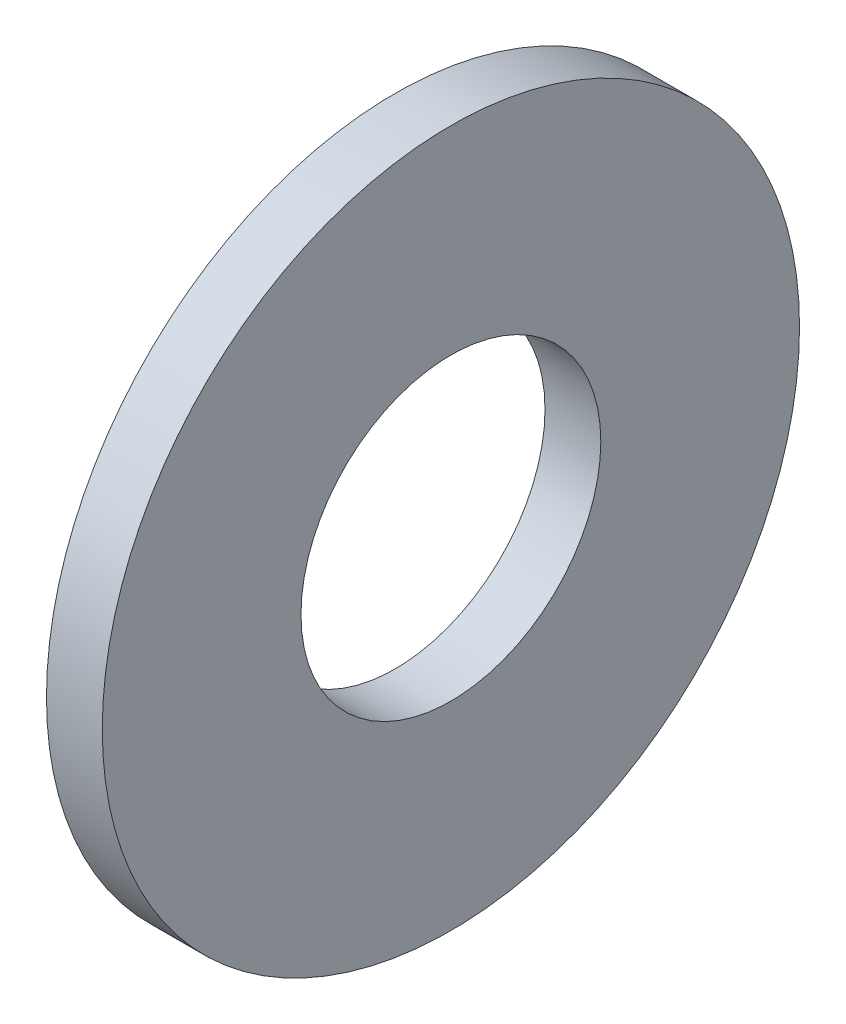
from build123d import *

# Parameters (mm, degrees)
ESQUISSE1_W = 0.8
ESQUISSE1_H = 2.85


with BuildPart() as part:
    # Esquisse1 → Base-R_volution (revolve)
    with BuildSketch(Plane(origin=(0, 0, 0), x_dir=(1, 0, 0), z_dir=(0, 1, 0)), mode=Mode.PRIVATE) as base_r_volution_sk:
        with Locations((0.4, 3.575)):
            Rectangle(ESQUISSE1_W, ESQUISSE1_H)
    revolve(base_r_volution_sk.sketch.rotate(Axis((0, 0, 0), (1, 0, 0)), 180), axis=Axis((0, 0, 0), (1, 0, 0)))


solid = part.part
